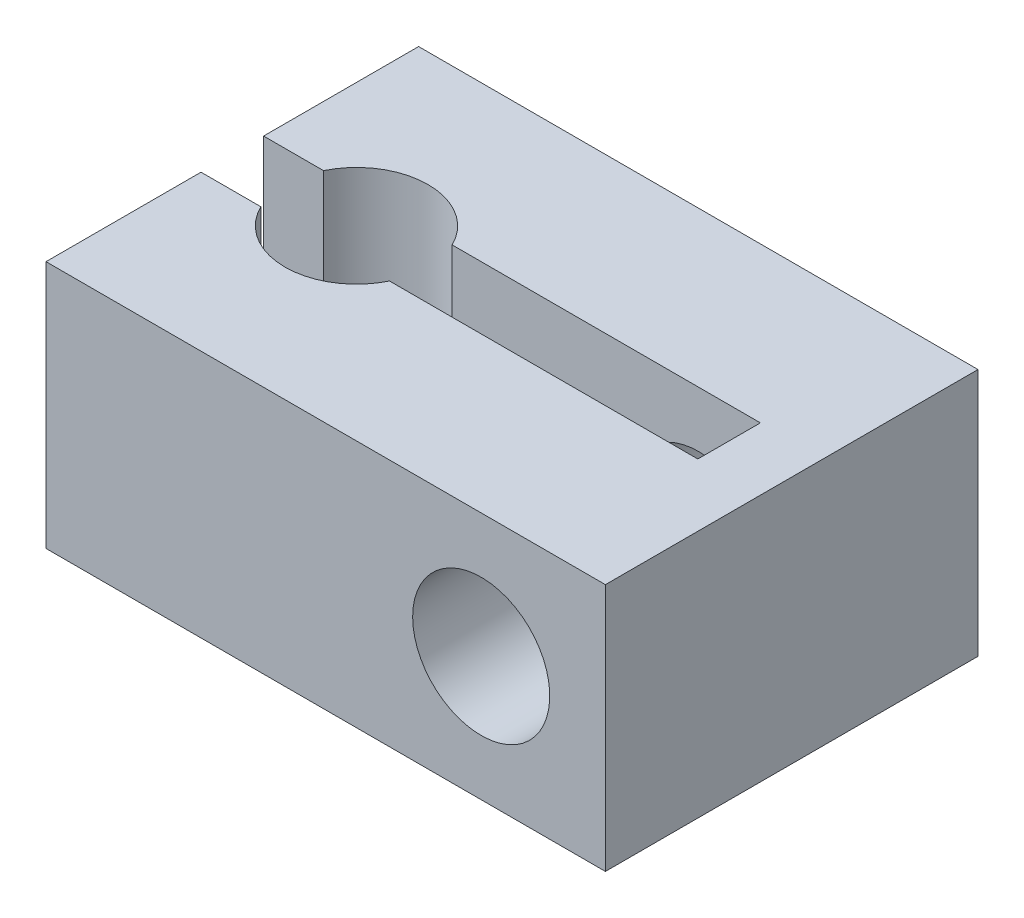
from build123d import *

# Parameters (mm, degrees)
SKETCH1_W          = 14.3002
SKETCH1_H          = 9.525
EXTRUDE1_DEPTH     = 3.175
CUT_EXTRUDE1_DEPTH = 11.683063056
SKETCH3_R          = 1.7526
CUT_EXTRUDE2_DEPTH = 13.325996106


with BuildPart() as part:
    # Sketch1 → Extrude1 (new, symmetric)
    with BuildSketch(Plane(origin=(0, 0, 0), x_dir=(1, 0, 0), z_dir=(0, 1, 0))):
        Rectangle(SKETCH1_W, SKETCH1_H)
    extrude(amount=EXTRUDE1_DEPTH, both=True)

    # Sketch2 → Cut-Extrude1 (cut, through all)
    with BuildSketch(Plane(origin=(0, 3.175, 0), x_dir=(-1, 0, 0), z_dir=(0, 1, 0))):
        with BuildLine():
            Line((7.1501, -0.8001), (5.619590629, -0.8001))
            ThreePointArc((5.619590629, -0.8001), (3.9751, -1.8288), (2.330609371, -0.8001))
            Line((2.330609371, -0.8001), (-5.5499, -0.8001))
            Line((-5.5499, -0.8001), (-5.5499, 0.8001))
            Line((-5.5499, 0.8001), (2.330609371, 0.8001))
            ThreePointArc((2.330609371, 0.8001), (3.9751, 1.8288), (5.619590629, 0.8001))
            Line((5.619590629, 0.8001), (7.1501, 0.8001))
            Line((7.1501, 0.8001), (7.1501, -0.8001))
        make_face()
    extrude(amount=-CUT_EXTRUDE1_DEPTH, mode=Mode.SUBTRACT)

    # Sketch3 → Cut-Extrude2 (cut, through all)
    with BuildSketch(Plane(origin=(0, 0, -4.7625), x_dir=(-1, 0, 0), z_dir=(0, 0, -1))):
        with Locations((-3.9751, 0)):
            Circle(SKETCH3_R)
    extrude(amount=-CUT_EXTRUDE2_DEPTH, mode=Mode.SUBTRACT)


solid = part.part
